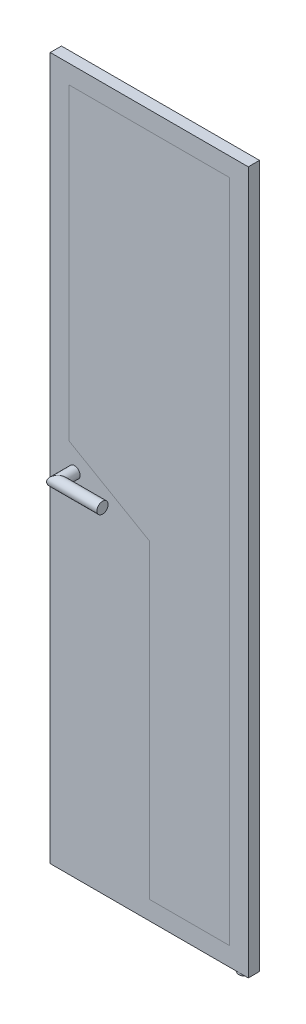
ISO-10303-21;
HEADER;
FILE_DESCRIPTION(('STEP AP214'),'2;1');
FILE_NAME('part.step','',(''),(''),'','','');
FILE_SCHEMA(('AUTOMOTIVE_DESIGN { 1 0 10303 214 1 1 1 1 }'));
ENDSEC;
DATA;
#1=APPLICATION_CONTEXT('core data for automotive mechanical design processes');
#2=APPLICATION_PROTOCOL_DEFINITION('international standard','automotive_design',2000,#1);
#3=PRODUCT_CONTEXT('',#1,'mechanical');
#4=PRODUCT('Part','Part','',(#3));
#5=PRODUCT_RELATED_PRODUCT_CATEGORY('part','',(#4));
#6=PRODUCT_DEFINITION_FORMATION('','',#4);
#7=PRODUCT_DEFINITION_CONTEXT('part definition',#1,'design');
#8=PRODUCT_DEFINITION('design','',#6,#7);
#9=PRODUCT_DEFINITION_SHAPE('','',#8);
#10=(LENGTH_UNIT() NAMED_UNIT(*) SI_UNIT(.MILLI.,.METRE.));
#11=(NAMED_UNIT(*) PLANE_ANGLE_UNIT() SI_UNIT($,.RADIAN.));
#12=(NAMED_UNIT(*) SI_UNIT($,.STERADIAN.) SOLID_ANGLE_UNIT());
#13=UNCERTAINTY_MEASURE_WITH_UNIT(LENGTH_MEASURE(1.E-05),#10,'distance_accuracy_value','');
#14=(GEOMETRIC_REPRESENTATION_CONTEXT(3) GLOBAL_UNCERTAINTY_ASSIGNED_CONTEXT((#13)) GLOBAL_UNIT_ASSIGNED_CONTEXT((#10,
#11,#12)) REPRESENTATION_CONTEXT('',''));
#15=CARTESIAN_POINT('',(0.,0.,0.));
#16=DIRECTION('',(0.,0.,1.));
#17=DIRECTION('',(1.,0.,0.));
#18=AXIS2_PLACEMENT_3D('',#15,#16,#17);
#19=CARTESIAN_POINT('',(-25.6041743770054,-44.3477309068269,15.));
#20=DIRECTION('',(0.499999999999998,0.86602540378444,0.));
#21=DIRECTION('',(-0.86602540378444,0.499999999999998,0.));
#22=AXIS2_PLACEMENT_3D('',#19,#20,#21);
#23=PLANE('',#22);
#24=DIRECTION('',(0.86602540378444,-0.499999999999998,0.));
#25=VECTOR('',#24,1.);
#26=CARTESIAN_POINT('',(-25.6041743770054,-44.3477309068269,-15.));
#27=LINE('',#26,#25);
#28=CARTESIAN_POINT('',(-215.,64.9999999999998,-15.));
#29=VERTEX_POINT('',#28);
#30=CARTESIAN_POINT('',(-1.6306400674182E-13,-59.1303078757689,-15.));
#31=VERTEX_POINT('',#30);
#32=EDGE_CURVE('E134',#29,#31,#27,.T.);
#33=ORIENTED_EDGE('',*,*,#32,.T.);
#34=DIRECTION('',(0.,0.,-1.));
#35=VECTOR('',#34,1.);
#36=CARTESIAN_POINT('',(-1.6306400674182E-13,-59.1303078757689,15.));
#37=LINE('',#36,#35);
#38=CARTESIAN_POINT('',(-1.6306400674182E-13,-59.1303078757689,15.));
#39=VERTEX_POINT('',#38);
#40=EDGE_CURVE('E12',#39,#31,#37,.T.);
#41=ORIENTED_EDGE('',*,*,#40,.F.);
#42=DIRECTION('',(0.86602540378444,-0.499999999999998,0.));
#43=VECTOR('',#42,1.);
#44=CARTESIAN_POINT('',(-25.6041743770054,-44.3477309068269,15.));
#45=LINE('',#44,#43);
#46=CARTESIAN_POINT('',(-215.,64.9999999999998,15.));
#47=VERTEX_POINT('',#46);
#48=EDGE_CURVE('E146',#47,#39,#45,.T.);
#49=ORIENTED_EDGE('',*,*,#48,.F.);
#50=DIRECTION('',(0.,0.,-1.));
#51=VECTOR('',#50,1.);
#52=CARTESIAN_POINT('',(-215.,64.9999999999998,15.));
#53=LINE('',#52,#51);
#54=EDGE_CURVE('E65',#47,#29,#53,.T.);
#55=ORIENTED_EDGE('',*,*,#54,.T.);
#56=EDGE_LOOP('',(#33,#41,#49,#55));
#57=FACE_BOUND('',#56,.T.);
#58=ADVANCED_FACE('F49',(#57),#23,.F.);
#59=CARTESIAN_POINT('',(-1.74434551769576E-13,0.,15.));
#60=DIRECTION('',(1.,0.,0.));
#61=DIRECTION('',(0.,1.,0.));
#62=AXIS2_PLACEMENT_3D('',#59,#60,#61);
#63=PLANE('',#62);
#64=DIRECTION('',(0.,-1.,0.));
#65=VECTOR('',#64,1.);
#66=CARTESIAN_POINT('',(-1.74434551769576E-13,0.,-15.));
#67=LINE('',#66,#65);
#68=CARTESIAN_POINT('',(0.,-890.,-15.));
#69=VERTEX_POINT('',#68);
#70=EDGE_CURVE('E136',#31,#69,#67,.T.);
#71=ORIENTED_EDGE('',*,*,#70,.T.);
#72=DIRECTION('',(0.,0.,-1.));
#73=VECTOR('',#72,1.);
#74=CARTESIAN_POINT('',(0.,-890.,15.));
#75=LINE('',#74,#73);
#76=CARTESIAN_POINT('',(0.,-890.,15.));
#77=VERTEX_POINT('',#76);
#78=EDGE_CURVE('E57',#77,#69,#75,.T.);
#79=ORIENTED_EDGE('',*,*,#78,.F.);
#80=DIRECTION('',(0.,-1.,0.));
#81=VECTOR('',#80,1.);
#82=CARTESIAN_POINT('',(-1.74434551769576E-13,0.,15.));
#83=LINE('',#82,#81);
#84=EDGE_CURVE('E97',#39,#77,#83,.T.);
#85=ORIENTED_EDGE('',*,*,#84,.F.);
#86=ORIENTED_EDGE('',*,*,#40,.T.);
#87=EDGE_LOOP('',(#71,#79,#85,#86));
#88=FACE_BOUND('',#87,.T.);
#89=ADVANCED_FACE('F166',(#88),#63,.F.);
#90=CARTESIAN_POINT('',(0.,-890.,15.));
#91=DIRECTION('',(0.,1.,0.));
#92=DIRECTION('',(0.,0.,1.));
#93=AXIS2_PLACEMENT_3D('',#90,#91,#92);
#94=PLANE('',#93);
#95=DIRECTION('',(1.,0.,0.));
#96=VECTOR('',#95,1.);
#97=CARTESIAN_POINT('',(0.,-890.,-15.));
#98=LINE('',#97,#96);
#99=CARTESIAN_POINT('',(215.,-890.,-15.));
#100=VERTEX_POINT('',#99);
#101=EDGE_CURVE('E138',#69,#100,#98,.T.);
#102=ORIENTED_EDGE('',*,*,#101,.T.);
#103=DIRECTION('',(0.,0.,-1.));
#104=VECTOR('',#103,1.);
#105=CARTESIAN_POINT('',(215.,-890.,15.));
#106=LINE('',#105,#104);
#107=CARTESIAN_POINT('',(215.,-890.,15.));
#108=VERTEX_POINT('',#107);
#109=EDGE_CURVE('E126',#108,#100,#106,.T.);
#110=ORIENTED_EDGE('',*,*,#109,.F.);
#111=DIRECTION('',(1.,0.,0.));
#112=VECTOR('',#111,1.);
#113=CARTESIAN_POINT('',(0.,-890.,15.));
#114=LINE('',#113,#112);
#115=EDGE_CURVE('E114',#77,#108,#114,.T.);
#116=ORIENTED_EDGE('',*,*,#115,.F.);
#117=ORIENTED_EDGE('',*,*,#78,.T.);
#118=EDGE_LOOP('',(#102,#110,#116,#117));
#119=FACE_BOUND('',#118,.T.);
#120=ADVANCED_FACE('F152',(#119),#94,.F.);
#121=CARTESIAN_POINT('',(215.,0.,15.));
#122=DIRECTION('',(-1.,0.,0.));
#123=DIRECTION('',(0.,0.,1.));
#124=AXIS2_PLACEMENT_3D('',#121,#122,#123);
#125=PLANE('',#124);
#126=DIRECTION('',(0.,1.,0.));
#127=VECTOR('',#126,1.);
#128=CARTESIAN_POINT('',(215.,0.,-15.));
#129=LINE('',#128,#127);
#130=CARTESIAN_POINT('',(215.,890.,-15.));
#131=VERTEX_POINT('',#130);
#132=EDGE_CURVE('E123',#100,#131,#129,.T.);
#133=ORIENTED_EDGE('',*,*,#132,.T.);
#134=DIRECTION('',(0.,0.,-1.));
#135=VECTOR('',#134,1.);
#136=CARTESIAN_POINT('',(215.,890.,15.));
#137=LINE('',#136,#135);
#138=CARTESIAN_POINT('',(215.,890.,15.));
#139=VERTEX_POINT('',#138);
#140=EDGE_CURVE('E120',#139,#131,#137,.T.);
#141=ORIENTED_EDGE('',*,*,#140,.F.);
#142=DIRECTION('',(0.,1.,0.));
#143=VECTOR('',#142,1.);
#144=CARTESIAN_POINT('',(215.,0.,15.));
#145=LINE('',#144,#143);
#146=EDGE_CURVE('E107',#108,#139,#145,.T.);
#147=ORIENTED_EDGE('',*,*,#146,.F.);
#148=ORIENTED_EDGE('',*,*,#109,.T.);
#149=EDGE_LOOP('',(#133,#141,#147,#148));
#150=FACE_BOUND('',#149,.T.);
#151=ADVANCED_FACE('F121',(#150),#125,.F.);
#152=CARTESIAN_POINT('',(0.,890.,15.));
#153=DIRECTION('',(0.,1.,0.));
#154=DIRECTION('',(0.,0.,1.));
#155=AXIS2_PLACEMENT_3D('',#152,#153,#154);
#156=PLANE('',#155);
#157=DIRECTION('',(1.,0.,0.));
#158=VECTOR('',#157,1.);
#159=CARTESIAN_POINT('',(0.,890.,-15.));
#160=LINE('',#159,#158);
#161=CARTESIAN_POINT('',(-215.,890.,-15.));
#162=VERTEX_POINT('',#161);
#163=EDGE_CURVE('E141',#162,#131,#160,.T.);
#164=ORIENTED_EDGE('',*,*,#163,.F.);
#165=DIRECTION('',(0.,0.,-1.));
#166=VECTOR('',#165,1.);
#167=CARTESIAN_POINT('',(-215.,890.,15.));
#168=LINE('',#167,#166);
#169=CARTESIAN_POINT('',(-215.,890.,15.));
#170=VERTEX_POINT('',#169);
#171=EDGE_CURVE('E85',#170,#162,#168,.T.);
#172=ORIENTED_EDGE('',*,*,#171,.F.);
#173=DIRECTION('',(1.,0.,0.));
#174=VECTOR('',#173,1.);
#175=CARTESIAN_POINT('',(0.,890.,15.));
#176=LINE('',#175,#174);
#177=EDGE_CURVE('E112',#170,#139,#176,.T.);
#178=ORIENTED_EDGE('',*,*,#177,.T.);
#179=ORIENTED_EDGE('',*,*,#140,.T.);
#180=EDGE_LOOP('',(#164,#172,#178,#179));
#181=FACE_BOUND('',#180,.T.);
#182=ADVANCED_FACE('F128',(#181),#156,.T.);
#183=CARTESIAN_POINT('',(-215.,0.,15.));
#184=DIRECTION('',(-1.,0.,0.));
#185=DIRECTION('',(0.,0.,1.));
#186=AXIS2_PLACEMENT_3D('',#183,#184,#185);
#187=PLANE('',#186);
#188=DIRECTION('',(0.,1.,0.));
#189=VECTOR('',#188,1.);
#190=CARTESIAN_POINT('',(-215.,0.,-15.));
#191=LINE('',#190,#189);
#192=EDGE_CURVE('E143',#29,#162,#191,.T.);
#193=ORIENTED_EDGE('',*,*,#192,.F.);
#194=ORIENTED_EDGE('',*,*,#54,.F.);
#195=DIRECTION('',(0.,1.,0.));
#196=VECTOR('',#195,1.);
#197=CARTESIAN_POINT('',(-215.,0.,15.));
#198=LINE('',#197,#196);
#199=EDGE_CURVE('E129',#47,#170,#198,.T.);
#200=ORIENTED_EDGE('',*,*,#199,.T.);
#201=ORIENTED_EDGE('',*,*,#171,.T.);
#202=EDGE_LOOP('',(#193,#194,#200,#201));
#203=FACE_BOUND('',#202,.T.);
#204=ADVANCED_FACE('F155',(#203),#187,.T.);
#205=CARTESIAN_POINT('',(0.,0.,15.));
#206=DIRECTION('',(0.,0.,1.));
#207=DIRECTION('',(1.,0.,0.));
#208=AXIS2_PLACEMENT_3D('',#205,#206,#207);
#209=PLANE('',#208);
#210=ORIENTED_EDGE('',*,*,#48,.T.);
#211=ORIENTED_EDGE('',*,*,#84,.T.);
#212=ORIENTED_EDGE('',*,*,#115,.T.);
#213=ORIENTED_EDGE('',*,*,#146,.T.);
#214=ORIENTED_EDGE('',*,*,#177,.F.);
#215=ORIENTED_EDGE('',*,*,#199,.F.);
#216=EDGE_LOOP('',(#210,#211,#212,#213,#214,#215));
#217=FACE_BOUND('',#216,.T.);
#218=ADVANCED_FACE('F109',(#217),#209,.T.);
#219=CARTESIAN_POINT('',(0.,0.,-15.));
#220=DIRECTION('',(0.,0.,1.));
#221=DIRECTION('',(1.,0.,0.));
#222=AXIS2_PLACEMENT_3D('',#219,#220,#221);
#223=PLANE('',#222);
#224=ORIENTED_EDGE('',*,*,#32,.F.);
#225=ORIENTED_EDGE('',*,*,#192,.T.);
#226=ORIENTED_EDGE('',*,*,#163,.T.);
#227=ORIENTED_EDGE('',*,*,#132,.F.);
#228=ORIENTED_EDGE('',*,*,#101,.F.);
#229=ORIENTED_EDGE('',*,*,#70,.F.);
#230=EDGE_LOOP('',(#224,#225,#226,#227,#228,#229));
#231=FACE_BOUND('',#230,.T.);
#232=ADVANCED_FACE('F154',(#231),#223,.F.);
#233=CLOSED_SHELL('',(#58,#89,#120,#151,#182,#204,#218,#232));
#234=MANIFOLD_SOLID_BREP('B2',#233);
#235=CARTESIAN_POINT('',(-265.,-940.,15.));
#236=DIRECTION('',(0.,1.,0.));
#237=DIRECTION('',(0.,0.,1.));
#238=AXIS2_PLACEMENT_3D('',#235,#236,#237);
#239=PLANE('',#238);
#240=CARTESIAN_POINT('',(240.,-940.,0.));
#241=DIRECTION('',(0.,1.,0.));
#242=DIRECTION('',(0.,0.,1.));
#243=AXIS2_PLACEMENT_3D('',#240,#241,#242);
#244=CIRCLE('',#243,15.);
#245=CARTESIAN_POINT('',(240.,-940.,15.));
#246=VERTEX_POINT('',#245);
#247=CARTESIAN_POINT('',(240.,-940.,-15.));
#248=VERTEX_POINT('',#247);
#249=EDGE_CURVE('E250',#246,#248,#244,.F.);
#250=ORIENTED_EDGE('',*,*,#249,.F.);
#251=DIRECTION('',(1.,0.,0.));
#252=VECTOR('',#251,1.);
#253=CARTESIAN_POINT('',(-265.,-940.,15.));
#254=LINE('',#253,#252);
#255=CARTESIAN_POINT('',(-265.,-940.,15.));
#256=VERTEX_POINT('',#255);
#257=EDGE_CURVE('E326',#256,#246,#254,.T.);
#258=ORIENTED_EDGE('',*,*,#257,.F.);
#259=DIRECTION('',(0.,0.,-1.));
#260=VECTOR('',#259,1.);
#261=CARTESIAN_POINT('',(-265.,-940.,15.));
#262=LINE('',#261,#260);
#263=CARTESIAN_POINT('',(-265.,-940.,-15.));
#264=VERTEX_POINT('',#263);
#265=EDGE_CURVE('E356',#256,#264,#262,.T.);
#266=ORIENTED_EDGE('',*,*,#265,.T.);
#267=DIRECTION('',(1.,0.,0.));
#268=VECTOR('',#267,1.);
#269=CARTESIAN_POINT('',(-265.,-940.,-15.));
#270=LINE('',#269,#268);
#271=EDGE_CURVE('E346',#264,#248,#270,.T.);
#272=ORIENTED_EDGE('',*,*,#271,.T.);
#273=EDGE_LOOP('',(#250,#258,#266,#272));
#274=FACE_BOUND('',#273,.T.);
#275=ADVANCED_FACE('F241',(#274),#239,.F.);
#276=CARTESIAN_POINT('',(0.,0.,15.));
#277=DIRECTION('',(0.,0.,-1.));
#278=DIRECTION('',(-1.,0.,0.));
#279=AXIS2_PLACEMENT_3D('',#276,#277,#278);
#280=PLANE('',#279);
#281=CARTESIAN_POINT('',(-200.,0.,15.));
#282=DIRECTION('',(0.,0.,-1.));
#283=DIRECTION('',(-1.,0.,0.));
#284=AXIS2_PLACEMENT_3D('',#281,#282,#283);
#285=CIRCLE('',#284,15.);
#286=CARTESIAN_POINT('',(-215.,0.,15.));
#287=VERTEX_POINT('',#286);
#288=EDGE_CURVE('E47',#287,#287,#285,.F.);
#289=ORIENTED_EDGE('',*,*,#288,.F.);
#290=EDGE_LOOP('',(#289));
#291=FACE_BOUND('',#290,.T.);
#292=ORIENTED_EDGE('',*,*,#257,.T.);
#293=CARTESIAN_POINT('',(265.,-940.,15.));
#294=VERTEX_POINT('',#293);
#295=EDGE_CURVE('E330',#246,#294,#254,.T.);
#296=ORIENTED_EDGE('',*,*,#295,.T.);
#297=DIRECTION('',(0.,1.,0.));
#298=VECTOR('',#297,1.);
#299=CARTESIAN_POINT('',(265.,-940.,15.));
#300=LINE('',#299,#298);
#301=CARTESIAN_POINT('',(265.,940.,15.));
#302=VERTEX_POINT('',#301);
#303=EDGE_CURVE('E360',#294,#302,#300,.T.);
#304=ORIENTED_EDGE('',*,*,#303,.T.);
#305=DIRECTION('',(-1.,0.,0.));
#306=VECTOR('',#305,1.);
#307=CARTESIAN_POINT('',(-265.,940.,15.));
#308=LINE('',#307,#306);
#309=CARTESIAN_POINT('',(-265.,940.,15.));
#310=VERTEX_POINT('',#309);
#311=EDGE_CURVE('E371',#302,#310,#308,.T.);
#312=ORIENTED_EDGE('',*,*,#311,.T.);
#313=DIRECTION('',(0.,-1.,0.));
#314=VECTOR('',#313,1.);
#315=CARTESIAN_POINT('',(-265.,-940.,15.));
#316=LINE('',#315,#314);
#317=EDGE_CURVE('E333',#310,#256,#316,.T.);
#318=ORIENTED_EDGE('',*,*,#317,.T.);
#319=EDGE_LOOP('',(#292,#296,#304,#312,#318));
#320=FACE_BOUND('',#319,.T.);
#321=DIRECTION('',(-1.,0.,0.));
#322=VECTOR('',#321,1.);
#323=CARTESIAN_POINT('',(-215.,890.,15.));
#324=LINE('',#323,#322);
#325=CARTESIAN_POINT('',(215.,890.,15.));
#326=VERTEX_POINT('',#325);
#327=CARTESIAN_POINT('',(-215.,890.,15.));
#328=VERTEX_POINT('',#327);
#329=EDGE_CURVE('E390',#326,#328,#324,.T.);
#330=ORIENTED_EDGE('',*,*,#329,.F.);
#331=DIRECTION('',(0.,1.,0.));
#332=VECTOR('',#331,1.);
#333=CARTESIAN_POINT('',(215.,-890.,15.));
#334=LINE('',#333,#332);
#335=CARTESIAN_POINT('',(215.,-890.,15.));
#336=VERTEX_POINT('',#335);
#337=EDGE_CURVE('E386',#336,#326,#334,.T.);
#338=ORIENTED_EDGE('',*,*,#337,.F.);
#339=DIRECTION('',(1.,0.,0.));
#340=VECTOR('',#339,1.);
#341=CARTESIAN_POINT('',(0.,-890.,15.));
#342=LINE('',#341,#340);
#343=CARTESIAN_POINT('',(0.,-890.,15.));
#344=VERTEX_POINT('',#343);
#345=EDGE_CURVE('E408',#344,#336,#342,.T.);
#346=ORIENTED_EDGE('',*,*,#345,.F.);
#347=DIRECTION('',(0.,-1.,0.));
#348=VECTOR('',#347,1.);
#349=CARTESIAN_POINT('',(-1.66533453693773E-13,-59.1303078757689,15.));
#350=LINE('',#349,#348);
#351=CARTESIAN_POINT('',(-1.66533453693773E-13,-59.1303078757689,15.));
#352=VERTEX_POINT('',#351);
#353=EDGE_CURVE('E410',#352,#344,#350,.T.);
#354=ORIENTED_EDGE('',*,*,#353,.F.);
#355=DIRECTION('',(0.86602540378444,-0.499999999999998,0.));
#356=VECTOR('',#355,1.);
#357=CARTESIAN_POINT('',(-215.,64.9999999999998,15.));
#358=LINE('',#357,#356);
#359=CARTESIAN_POINT('',(-215.,64.9999999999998,15.));
#360=VERTEX_POINT('',#359);
#361=EDGE_CURVE('E412',#360,#352,#358,.T.);
#362=ORIENTED_EDGE('',*,*,#361,.F.);
#363=DIRECTION('',(0.,-1.,0.));
#364=VECTOR('',#363,1.);
#365=CARTESIAN_POINT('',(-215.,64.9999999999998,15.));
#366=LINE('',#365,#364);
#367=EDGE_CURVE('E414',#328,#360,#366,.T.);
#368=ORIENTED_EDGE('',*,*,#367,.F.);
#369=EDGE_LOOP('',(#330,#338,#346,#354,#362,#368));
#370=FACE_BOUND('',#369,.T.);
#371=ADVANCED_FACE('F327',(#291,#320,#370),#280,.F.);
#372=CARTESIAN_POINT('',(0.,0.,-15.));
#373=DIRECTION('',(0.,0.,-1.));
#374=DIRECTION('',(-1.,0.,0.));
#375=AXIS2_PLACEMENT_3D('',#372,#373,#374);
#376=PLANE('',#375);
#377=CARTESIAN_POINT('',(-200.,0.,-15.));
#378=DIRECTION('',(0.,0.,-1.));
#379=DIRECTION('',(-1.,0.,0.));
#380=AXIS2_PLACEMENT_3D('',#377,#378,#379);
#381=CIRCLE('',#380,15.);
#382=CARTESIAN_POINT('',(-215.,0.,-15.));
#383=VERTEX_POINT('',#382);
#384=EDGE_CURVE('E245',#383,#383,#381,.F.);
#385=ORIENTED_EDGE('',*,*,#384,.T.);
#386=EDGE_LOOP('',(#385));
#387=FACE_BOUND('',#386,.T.);
#388=CARTESIAN_POINT('',(265.,-940.,-15.));
#389=VERTEX_POINT('',#388);
#390=EDGE_CURVE('E361',#248,#389,#270,.T.);
#391=ORIENTED_EDGE('',*,*,#390,.F.);
#392=ORIENTED_EDGE('',*,*,#271,.F.);
#393=DIRECTION('',(0.,-1.,0.));
#394=VECTOR('',#393,1.);
#395=CARTESIAN_POINT('',(-265.,-940.,-15.));
#396=LINE('',#395,#394);
#397=CARTESIAN_POINT('',(-265.,940.,-15.));
#398=VERTEX_POINT('',#397);
#399=EDGE_CURVE('E362',#398,#264,#396,.T.);
#400=ORIENTED_EDGE('',*,*,#399,.F.);
#401=DIRECTION('',(-1.,0.,0.));
#402=VECTOR('',#401,1.);
#403=CARTESIAN_POINT('',(-265.,940.,-15.));
#404=LINE('',#403,#402);
#405=CARTESIAN_POINT('',(265.,940.,-15.));
#406=VERTEX_POINT('',#405);
#407=EDGE_CURVE('E364',#406,#398,#404,.T.);
#408=ORIENTED_EDGE('',*,*,#407,.F.);
#409=DIRECTION('',(0.,1.,0.));
#410=VECTOR('',#409,1.);
#411=CARTESIAN_POINT('',(265.,-940.,-15.));
#412=LINE('',#411,#410);
#413=EDGE_CURVE('E366',#389,#406,#412,.T.);
#414=ORIENTED_EDGE('',*,*,#413,.F.);
#415=EDGE_LOOP('',(#391,#392,#400,#408,#414));
#416=FACE_BOUND('',#415,.T.);
#417=DIRECTION('',(0.,1.,0.));
#418=VECTOR('',#417,1.);
#419=CARTESIAN_POINT('',(215.,-890.,-15.));
#420=LINE('',#419,#418);
#421=CARTESIAN_POINT('',(215.,-890.,-15.));
#422=VERTEX_POINT('',#421);
#423=CARTESIAN_POINT('',(215.,890.,-15.));
#424=VERTEX_POINT('',#423);
#425=EDGE_CURVE('E387',#422,#424,#420,.T.);
#426=ORIENTED_EDGE('',*,*,#425,.T.);
#427=DIRECTION('',(-1.,0.,0.));
#428=VECTOR('',#427,1.);
#429=CARTESIAN_POINT('',(-215.,890.,-15.));
#430=LINE('',#429,#428);
#431=CARTESIAN_POINT('',(-215.,890.,-15.));
#432=VERTEX_POINT('',#431);
#433=EDGE_CURVE('E403',#424,#432,#430,.T.);
#434=ORIENTED_EDGE('',*,*,#433,.T.);
#435=DIRECTION('',(0.,-1.,0.));
#436=VECTOR('',#435,1.);
#437=CARTESIAN_POINT('',(-215.,64.9999999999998,-15.));
#438=LINE('',#437,#436);
#439=CARTESIAN_POINT('',(-215.,64.9999999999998,-15.));
#440=VERTEX_POINT('',#439);
#441=EDGE_CURVE('E400',#432,#440,#438,.T.);
#442=ORIENTED_EDGE('',*,*,#441,.T.);
#443=DIRECTION('',(0.86602540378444,-0.499999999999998,0.));
#444=VECTOR('',#443,1.);
#445=CARTESIAN_POINT('',(-215.,64.9999999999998,-15.));
#446=LINE('',#445,#444);
#447=CARTESIAN_POINT('',(-1.66533453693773E-13,-59.1303078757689,-15.));
#448=VERTEX_POINT('',#447);
#449=EDGE_CURVE('E397',#440,#448,#446,.T.);
#450=ORIENTED_EDGE('',*,*,#449,.T.);
#451=DIRECTION('',(0.,-1.,0.));
#452=VECTOR('',#451,1.);
#453=CARTESIAN_POINT('',(-1.66533453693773E-13,-59.1303078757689,-15.));
#454=LINE('',#453,#452);
#455=CARTESIAN_POINT('',(0.,-890.,-15.));
#456=VERTEX_POINT('',#455);
#457=EDGE_CURVE('E394',#448,#456,#454,.T.);
#458=ORIENTED_EDGE('',*,*,#457,.T.);
#459=DIRECTION('',(1.,0.,0.));
#460=VECTOR('',#459,1.);
#461=CARTESIAN_POINT('',(0.,-890.,-15.));
#462=LINE('',#461,#460);
#463=EDGE_CURVE('E391',#456,#422,#462,.T.);
#464=ORIENTED_EDGE('',*,*,#463,.T.);
#465=EDGE_LOOP('',(#426,#434,#442,#450,#458,#464));
#466=FACE_BOUND('',#465,.T.);
#467=ADVANCED_FACE('F448',(#387,#416,#466),#376,.T.);
#468=CARTESIAN_POINT('',(265.,-940.,15.));
#469=DIRECTION('',(-1.,0.,0.));
#470=DIRECTION('',(0.,0.,1.));
#471=AXIS2_PLACEMENT_3D('',#468,#469,#470);
#472=PLANE('',#471);
#473=ORIENTED_EDGE('',*,*,#413,.T.);
#474=DIRECTION('',(0.,0.,-1.));
#475=VECTOR('',#474,1.);
#476=CARTESIAN_POINT('',(265.,940.,15.));
#477=LINE('',#476,#475);
#478=EDGE_CURVE('E349',#302,#406,#477,.T.);
#479=ORIENTED_EDGE('',*,*,#478,.F.);
#480=ORIENTED_EDGE('',*,*,#303,.F.);
#481=DIRECTION('',(0.,0.,-1.));
#482=VECTOR('',#481,1.);
#483=CARTESIAN_POINT('',(265.,-940.,15.));
#484=LINE('',#483,#482);
#485=EDGE_CURVE('E338',#294,#389,#484,.T.);
#486=ORIENTED_EDGE('',*,*,#485,.T.);
#487=EDGE_LOOP('',(#473,#479,#480,#486));
#488=FACE_BOUND('',#487,.T.);
#489=ADVANCED_FACE('F243',(#488),#472,.F.);
#490=CARTESIAN_POINT('',(-265.,940.,15.));
#491=DIRECTION('',(0.,-1.,0.));
#492=DIRECTION('',(0.,0.,-1.));
#493=AXIS2_PLACEMENT_3D('',#490,#491,#492);
#494=PLANE('',#493);
#495=ORIENTED_EDGE('',*,*,#407,.T.);
#496=DIRECTION('',(0.,0.,-1.));
#497=VECTOR('',#496,1.);
#498=CARTESIAN_POINT('',(-265.,940.,15.));
#499=LINE('',#498,#497);
#500=EDGE_CURVE('E351',#310,#398,#499,.T.);
#501=ORIENTED_EDGE('',*,*,#500,.F.);
#502=ORIENTED_EDGE('',*,*,#311,.F.);
#503=ORIENTED_EDGE('',*,*,#478,.T.);
#504=EDGE_LOOP('',(#495,#501,#502,#503));
#505=FACE_BOUND('',#504,.T.);
#506=ADVANCED_FACE('F464',(#505),#494,.F.);
#507=CARTESIAN_POINT('',(-265.,-940.,15.));
#508=DIRECTION('',(1.,0.,0.));
#509=DIRECTION('',(0.,0.,-1.));
#510=AXIS2_PLACEMENT_3D('',#507,#508,#509);
#511=PLANE('',#510);
#512=ORIENTED_EDGE('',*,*,#399,.T.);
#513=ORIENTED_EDGE('',*,*,#265,.F.);
#514=ORIENTED_EDGE('',*,*,#317,.F.);
#515=ORIENTED_EDGE('',*,*,#500,.T.);
#516=EDGE_LOOP('',(#512,#513,#514,#515));
#517=FACE_BOUND('',#516,.T.);
#518=ADVANCED_FACE('F462',(#517),#511,.F.);
#519=EDGE_CURVE('E258',#248,#246,#244,.F.);
#520=ORIENTED_EDGE('',*,*,#519,.F.);
#521=ORIENTED_EDGE('',*,*,#390,.T.);
#522=ORIENTED_EDGE('',*,*,#485,.F.);
#523=ORIENTED_EDGE('',*,*,#295,.F.);
#524=EDGE_LOOP('',(#520,#521,#522,#523));
#525=FACE_BOUND('',#524,.T.);
#526=ADVANCED_FACE('F340',(#525),#239,.F.);
#527=CARTESIAN_POINT('',(-215.,890.,15.));
#528=DIRECTION('',(0.,-1.,0.));
#529=DIRECTION('',(0.,0.,-1.));
#530=AXIS2_PLACEMENT_3D('',#527,#528,#529);
#531=PLANE('',#530);
#532=ORIENTED_EDGE('',*,*,#433,.F.);
#533=DIRECTION('',(0.,0.,-1.));
#534=VECTOR('',#533,1.);
#535=CARTESIAN_POINT('',(215.,890.,15.));
#536=LINE('',#535,#534);
#537=EDGE_CURVE('E383',#326,#424,#536,.T.);
#538=ORIENTED_EDGE('',*,*,#537,.F.);
#539=ORIENTED_EDGE('',*,*,#329,.T.);
#540=DIRECTION('',(0.,0.,-1.));
#541=VECTOR('',#540,1.);
#542=CARTESIAN_POINT('',(-215.,890.,15.));
#543=LINE('',#542,#541);
#544=EDGE_CURVE('E368',#328,#432,#543,.T.);
#545=ORIENTED_EDGE('',*,*,#544,.T.);
#546=EDGE_LOOP('',(#532,#538,#539,#545));
#547=FACE_BOUND('',#546,.T.);
#548=ADVANCED_FACE('F458',(#547),#531,.T.);
#549=CARTESIAN_POINT('',(-215.,64.9999999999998,15.));
#550=DIRECTION('',(1.,0.,0.));
#551=DIRECTION('',(0.,0.,-1.));
#552=AXIS2_PLACEMENT_3D('',#549,#550,#551);
#553=PLANE('',#552);
#554=ORIENTED_EDGE('',*,*,#441,.F.);
#555=ORIENTED_EDGE('',*,*,#544,.F.);
#556=ORIENTED_EDGE('',*,*,#367,.T.);
#557=DIRECTION('',(0.,0.,-1.));
#558=VECTOR('',#557,1.);
#559=CARTESIAN_POINT('',(-215.,64.9999999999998,15.));
#560=LINE('',#559,#558);
#561=EDGE_CURVE('E376',#360,#440,#560,.T.);
#562=ORIENTED_EDGE('',*,*,#561,.T.);
#563=EDGE_LOOP('',(#554,#555,#556,#562));
#564=FACE_BOUND('',#563,.T.);
#565=ADVANCED_FACE('F491',(#564),#553,.T.);
#566=CARTESIAN_POINT('',(-215.,64.9999999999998,15.));
#567=DIRECTION('',(0.499999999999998,0.86602540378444,0.));
#568=DIRECTION('',(-0.86602540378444,0.499999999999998,0.));
#569=AXIS2_PLACEMENT_3D('',#566,#567,#568);
#570=PLANE('',#569);
#571=ORIENTED_EDGE('',*,*,#449,.F.);
#572=ORIENTED_EDGE('',*,*,#561,.F.);
#573=ORIENTED_EDGE('',*,*,#361,.T.);
#574=DIRECTION('',(0.,0.,-1.));
#575=VECTOR('',#574,1.);
#576=CARTESIAN_POINT('',(-1.66533453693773E-13,-59.1303078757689,15.));
#577=LINE('',#576,#575);
#578=EDGE_CURVE('E378',#352,#448,#577,.T.);
#579=ORIENTED_EDGE('',*,*,#578,.T.);
#580=EDGE_LOOP('',(#571,#572,#573,#579));
#581=FACE_BOUND('',#580,.T.);
#582=ADVANCED_FACE('F494',(#581),#570,.T.);
#583=CARTESIAN_POINT('',(-1.66533453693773E-13,-59.1303078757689,15.));
#584=DIRECTION('',(1.,0.,0.));
#585=DIRECTION('',(0.,1.,0.));
#586=AXIS2_PLACEMENT_3D('',#583,#584,#585);
#587=PLANE('',#586);
#588=ORIENTED_EDGE('',*,*,#457,.F.);
#589=ORIENTED_EDGE('',*,*,#578,.F.);
#590=ORIENTED_EDGE('',*,*,#353,.T.);
#591=DIRECTION('',(0.,0.,-1.));
#592=VECTOR('',#591,1.);
#593=CARTESIAN_POINT('',(0.,-890.,15.));
#594=LINE('',#593,#592);
#595=EDGE_CURVE('E380',#344,#456,#594,.T.);
#596=ORIENTED_EDGE('',*,*,#595,.T.);
#597=EDGE_LOOP('',(#588,#589,#590,#596));
#598=FACE_BOUND('',#597,.T.);
#599=ADVANCED_FACE('F498',(#598),#587,.T.);
#600=CARTESIAN_POINT('',(0.,-890.,15.));
#601=DIRECTION('',(0.,1.,0.));
#602=DIRECTION('',(0.,0.,1.));
#603=AXIS2_PLACEMENT_3D('',#600,#601,#602);
#604=PLANE('',#603);
#605=ORIENTED_EDGE('',*,*,#463,.F.);
#606=ORIENTED_EDGE('',*,*,#595,.F.);
#607=ORIENTED_EDGE('',*,*,#345,.T.);
#608=DIRECTION('',(0.,0.,-1.));
#609=VECTOR('',#608,1.);
#610=CARTESIAN_POINT('',(215.,-890.,15.));
#611=LINE('',#610,#609);
#612=EDGE_CURVE('E266',#336,#422,#611,.T.);
#613=ORIENTED_EDGE('',*,*,#612,.T.);
#614=EDGE_LOOP('',(#605,#606,#607,#613));
#615=FACE_BOUND('',#614,.T.);
#616=ADVANCED_FACE('F501',(#615),#604,.T.);
#617=CARTESIAN_POINT('',(215.,-890.,15.));
#618=DIRECTION('',(-1.,0.,0.));
#619=DIRECTION('',(0.,0.,1.));
#620=AXIS2_PLACEMENT_3D('',#617,#618,#619);
#621=PLANE('',#620);
#622=ORIENTED_EDGE('',*,*,#425,.F.);
#623=ORIENTED_EDGE('',*,*,#612,.F.);
#624=ORIENTED_EDGE('',*,*,#337,.T.);
#625=ORIENTED_EDGE('',*,*,#537,.T.);
#626=EDGE_LOOP('',(#622,#623,#624,#625));
#627=FACE_BOUND('',#626,.T.);
#628=ADVANCED_FACE('F479',(#627),#621,.T.);
#629=CARTESIAN_POINT('',(240.,-945.,0.));
#630=DIRECTION('',(0.,1.,0.));
#631=DIRECTION('',(0.,0.,1.));
#632=AXIS2_PLACEMENT_3D('',#629,#630,#631);
#633=CYLINDRICAL_SURFACE('',#632,15.);
#634=CARTESIAN_POINT('',(240.,-945.,0.));
#635=DIRECTION('',(0.,-1.,0.));
#636=DIRECTION('',(0.,0.,-1.));
#637=AXIS2_PLACEMENT_3D('',#634,#635,#636);
#638=CIRCLE('',#637,15.);
#639=CARTESIAN_POINT('',(240.,-945.,-15.));
#640=VERTEX_POINT('',#639);
#641=EDGE_CURVE('E406',#640,#640,#638,.T.);
#642=ORIENTED_EDGE('',*,*,#641,.F.);
#643=EDGE_LOOP('',(#642));
#644=FACE_BOUND('',#643,.T.);
#645=ORIENTED_EDGE('',*,*,#519,.T.);
#646=ORIENTED_EDGE('',*,*,#249,.T.);
#647=EDGE_LOOP('',(#645,#646));
#648=FACE_BOUND('',#647,.T.);
#649=ADVANCED_FACE('F348',(#644,#648),#633,.T.);
#650=CARTESIAN_POINT('',(240.,-945.,0.));
#651=DIRECTION('',(0.,-1.,0.));
#652=DIRECTION('',(0.,0.,-1.));
#653=AXIS2_PLACEMENT_3D('',#650,#651,#652);
#654=PLANE('',#653);
#655=ORIENTED_EDGE('',*,*,#641,.T.);
#656=EDGE_LOOP('',(#655));
#657=FACE_BOUND('',#656,.T.);
#658=ADVANCED_FACE('F563',(#657),#654,.T.);
#659=CARTESIAN_POINT('',(-80.,0.,-60.));
#660=DIRECTION('',(-1.,0.,0.));
#661=DIRECTION('',(0.,0.,1.));
#662=AXIS2_PLACEMENT_3D('',#659,#660,#661);
#663=PLANE('',#662);
#664=CARTESIAN_POINT('',(-80.,0.,-60.));
#665=DIRECTION('',(-1.,0.,0.));
#666=DIRECTION('',(0.,0.,1.));
#667=AXIS2_PLACEMENT_3D('',#664,#665,#666);
#668=CIRCLE('',#667,15.);
#669=CARTESIAN_POINT('',(-80.,0.,-45.));
#670=VERTEX_POINT('',#669);
#671=EDGE_CURVE('E419',#670,#670,#668,.T.);
#672=ORIENTED_EDGE('',*,*,#671,.F.);
#673=EDGE_LOOP('',(#672));
#674=FACE_BOUND('',#673,.T.);
#675=ADVANCED_FACE('F557',(#674),#663,.F.);
#676=CARTESIAN_POINT('',(-216.6,0.,-60.));
#677=DIRECTION('',(1.,0.,0.));
#678=DIRECTION('',(0.,0.,-1.));
#679=AXIS2_PLACEMENT_3D('',#676,#677,#678);
#680=CYLINDRICAL_SURFACE('',#679,15.);
#681=CARTESIAN_POINT('',(-200.,0.,-60.));
#682=DIRECTION('',(0.707106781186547,0.,-0.707106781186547));
#683=DIRECTION('',(-0.707106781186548,0.,-0.707106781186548));
#684=AXIS2_PLACEMENT_3D('',#681,#682,#683);
#685=ELLIPSE('',#684,21.2132034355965,15.);
#686=CARTESIAN_POINT('',(-215.,0.,-75.));
#687=VERTEX_POINT('',#686);
#688=EDGE_CURVE('E422',#687,#687,#685,.T.);
#689=ORIENTED_EDGE('',*,*,#688,.T.);
#690=EDGE_LOOP('',(#689));
#691=FACE_BOUND('',#690,.T.);
#692=ORIENTED_EDGE('',*,*,#671,.T.);
#693=EDGE_LOOP('',(#692));
#694=FACE_BOUND('',#693,.T.);
#695=ADVANCED_FACE('F562',(#691,#694),#680,.T.);
#696=CARTESIAN_POINT('',(-200.,0.,76.6));
#697=DIRECTION('',(0.,0.,-1.));
#698=DIRECTION('',(-1.,0.,0.));
#699=AXIS2_PLACEMENT_3D('',#696,#697,#698);
#700=CYLINDRICAL_SURFACE('',#699,15.);
#701=ORIENTED_EDGE('',*,*,#384,.F.);
#702=EDGE_LOOP('',(#701));
#703=FACE_BOUND('',#702,.T.);
#704=ORIENTED_EDGE('',*,*,#688,.F.);
#705=EDGE_LOOP('',(#704));
#706=FACE_BOUND('',#705,.T.);
#707=ADVANCED_FACE('F443',(#703,#706),#700,.T.);
#708=CARTESIAN_POINT('',(-200.,0.,60.));
#709=DIRECTION('',(-0.707106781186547,0.,-0.707106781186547));
#710=DIRECTION('',(-0.707106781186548,0.,0.707106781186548));
#711=AXIS2_PLACEMENT_3D('',#708,#709,#710);
#712=ELLIPSE('',#711,21.2132034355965,15.);
#713=CARTESIAN_POINT('',(-215.,0.,75.));
#714=VERTEX_POINT('',#713);
#715=EDGE_CURVE('E426',#714,#714,#712,.T.);
#716=ORIENTED_EDGE('',*,*,#715,.T.);
#717=EDGE_LOOP('',(#716));
#718=FACE_BOUND('',#717,.T.);
#719=ORIENTED_EDGE('',*,*,#288,.T.);
#720=EDGE_LOOP('',(#719));
#721=FACE_BOUND('',#720,.T.);
#722=ADVANCED_FACE('F438',(#718,#721),#700,.T.);
#723=CARTESIAN_POINT('',(-80.,0.,60.));
#724=DIRECTION('',(1.,0.,0.));
#725=DIRECTION('',(0.,0.,-1.));
#726=AXIS2_PLACEMENT_3D('',#723,#724,#725);
#727=PLANE('',#726);
#728=CARTESIAN_POINT('',(-80.,0.,60.));
#729=DIRECTION('',(1.,0.,0.));
#730=DIRECTION('',(0.,0.,-1.));
#731=AXIS2_PLACEMENT_3D('',#728,#729,#730);
#732=CIRCLE('',#731,15.);
#733=CARTESIAN_POINT('',(-80.,0.,45.));
#734=VERTEX_POINT('',#733);
#735=EDGE_CURVE('E425',#734,#734,#732,.T.);
#736=ORIENTED_EDGE('',*,*,#735,.T.);
#737=EDGE_LOOP('',(#736));
#738=FACE_BOUND('',#737,.T.);
#739=ADVANCED_FACE('F432',(#738),#727,.T.);
#740=CARTESIAN_POINT('',(-80.,0.,60.));
#741=DIRECTION('',(-1.,0.,0.));
#742=DIRECTION('',(0.,0.,1.));
#743=AXIS2_PLACEMENT_3D('',#740,#741,#742);
#744=CYLINDRICAL_SURFACE('',#743,15.);
#745=ORIENTED_EDGE('',*,*,#735,.F.);
#746=EDGE_LOOP('',(#745));
#747=FACE_BOUND('',#746,.T.);
#748=ORIENTED_EDGE('',*,*,#715,.F.);
#749=EDGE_LOOP('',(#748));
#750=FACE_BOUND('',#749,.T.);
#751=ADVANCED_FACE('F434',(#747,#750),#744,.T.);
#752=CLOSED_SHELL('',(#275,#371,#467,#489,#506,#518,#526,#548,#565,#582,#599,#616,#628,#649,
#658,#675,#695,#707,#722,#739,#751));
#753=MANIFOLD_SOLID_BREP('B6',#752);
#754=ADVANCED_BREP_SHAPE_REPRESENTATION('',(#18,#234,#753),#14);
#755=SHAPE_DEFINITION_REPRESENTATION(#9,#754);
ENDSEC;
END-ISO-10303-21;
